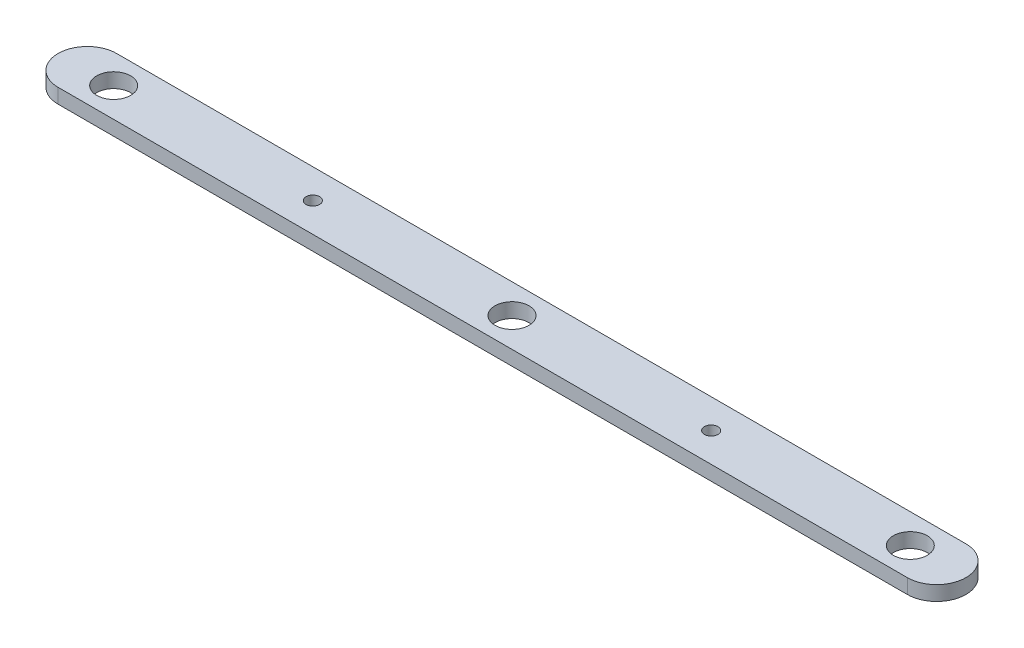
from build123d import *

# Parameters (mm, degrees)
SKETCH1_R             = 3.683
BOSS_EXTRUDE1_DEPTH   = 3.175
F_4_CLEARANCE_HOLE1_D = 2.9464


with BuildPart() as part:
    # Sketch1 → Boss-Extrude1 (new body)
    with BuildSketch(Plane(origin=(0, 0, 0), x_dir=(1, 0, 0), z_dir=(0, 1, 0))):
        with BuildLine():
            Line((0, 6.35), (184.15, 6.35))
            ThreePointArc((184.15, 6.35), (190.5, 0), (184.15, -6.35))
            Line((184.15, -6.35), (0, -6.35))
            ThreePointArc((0, -6.35), (-6.35, 0), (0, 6.35))
        make_face()
        with Locations(Location((92.075, 0, 0), (0, 0, 270))):
            Circle(SKETCH1_R, mode=Mode.SUBTRACT)
        with Locations(Location((5.715, 0, 0), (0, 0, 270))):
            Circle(SKETCH1_R, mode=Mode.SUBTRACT)
        with Locations(Location((178.435, 0, 0), (0, 0, 270))):
            Circle(SKETCH1_R, mode=Mode.SUBTRACT)
    extrude(amount=BOSS_EXTRUDE1_DEPTH)

    # 4 Clearance Hole1 (through all)
    with Locations(Plane(origin=(0, 3.175, 0), x_dir=(1, 0, 0), z_dir=(0, 1, 0))):
        with Locations((48.895, 0), (135.255, 0)):
            Hole(F_4_CLEARANCE_HOLE1_D / 2)


solid = part.part
